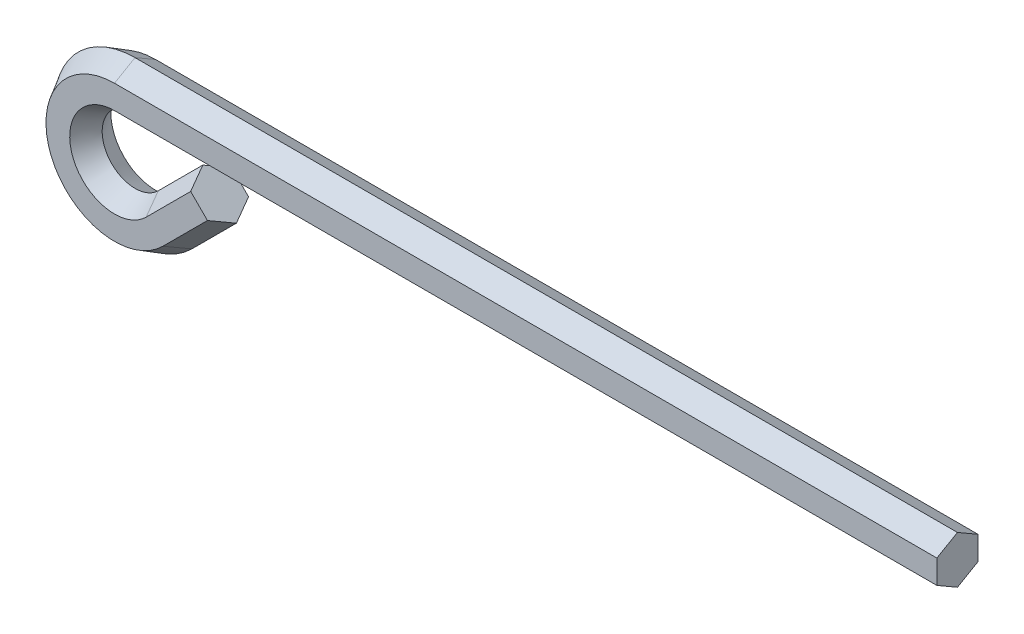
ISO-10303-21;
HEADER;
FILE_DESCRIPTION(('STEP AP214'),'2;1');
FILE_NAME('part.step','',(''),(''),'','','');
FILE_SCHEMA(('AUTOMOTIVE_DESIGN { 1 0 10303 214 1 1 1 1 }'));
ENDSEC;
DATA;
#1=APPLICATION_CONTEXT('core data for automotive mechanical design processes');
#2=APPLICATION_PROTOCOL_DEFINITION('international standard','automotive_design',2000,#1);
#3=PRODUCT_CONTEXT('',#1,'mechanical');
#4=PRODUCT('Part','Part','',(#3));
#5=PRODUCT_RELATED_PRODUCT_CATEGORY('part','',(#4));
#6=PRODUCT_DEFINITION_FORMATION('','',#4);
#7=PRODUCT_DEFINITION_CONTEXT('part definition',#1,'design');
#8=PRODUCT_DEFINITION('design','',#6,#7);
#9=PRODUCT_DEFINITION_SHAPE('','',#8);
#10=(LENGTH_UNIT() NAMED_UNIT(*) SI_UNIT(.MILLI.,.METRE.));
#11=(NAMED_UNIT(*) PLANE_ANGLE_UNIT() SI_UNIT($,.RADIAN.));
#12=(NAMED_UNIT(*) SI_UNIT($,.STERADIAN.) SOLID_ANGLE_UNIT());
#13=UNCERTAINTY_MEASURE_WITH_UNIT(LENGTH_MEASURE(1.E-05),#10,'distance_accuracy_value','');
#14=(GEOMETRIC_REPRESENTATION_CONTEXT(3) GLOBAL_UNCERTAINTY_ASSIGNED_CONTEXT((#13)) GLOBAL_UNIT_ASSIGNED_CONTEXT((#10,
#11,#12)) REPRESENTATION_CONTEXT('',''));
#15=CARTESIAN_POINT('',(0.,0.,0.));
#16=DIRECTION('',(0.,0.,1.));
#17=DIRECTION('',(1.,0.,0.));
#18=AXIS2_PLACEMENT_3D('',#15,#16,#17);
#19=CARTESIAN_POINT('',(5.89028930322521,-5.89028930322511,-2.5));
#20=DIRECTION('',(-0.612372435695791,0.612372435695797,0.500000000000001));
#21=DIRECTION('',(-0.707106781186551,-0.707106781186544,0.));
#22=AXIS2_PLACEMENT_3D('',#19,#20,#21);
#23=PLANE('',#22);
#24=DIRECTION('',(0.353553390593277,-0.353553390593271,0.866025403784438));
#25=VECTOR('',#24,1.);
#26=CARTESIAN_POINT('',(5.89028930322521,-5.89028930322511,-2.5));
#27=LINE('',#26,#25);
#28=CARTESIAN_POINT('',(5.89028930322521,-5.89028930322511,-2.5));
#29=VERTEX_POINT('',#28);
#30=CARTESIAN_POINT('',(6.91091002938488,-6.91091002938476,0.));
#31=VERTEX_POINT('',#30);
#32=EDGE_CURVE('E185',#29,#31,#27,.T.);
#33=ORIENTED_EDGE('',*,*,#32,.F.);
#34=DIRECTION('',(0.707106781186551,0.707106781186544,0.));
#35=VECTOR('',#34,1.);
#36=CARTESIAN_POINT('',(5.89028930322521,-5.89028930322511,-2.5));
#37=LINE('',#36,#35);
#38=CARTESIAN_POINT('',(11.3045028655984,-0.476075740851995,-2.5));
#39=VERTEX_POINT('',#38);
#40=EDGE_CURVE('E39',#29,#39,#37,.T.);
#41=ORIENTED_EDGE('',*,*,#40,.T.);
#42=DIRECTION('',(0.353553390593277,-0.353553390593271,0.866025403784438));
#43=VECTOR('',#42,1.);
#44=CARTESIAN_POINT('',(11.3045028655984,-0.476075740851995,-2.5));
#45=LINE('',#44,#43);
#46=CARTESIAN_POINT('',(12.3251235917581,-1.49669646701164,0.));
#47=VERTEX_POINT('',#46);
#48=EDGE_CURVE('E46',#39,#47,#45,.T.);
#49=ORIENTED_EDGE('',*,*,#48,.T.);
#50=DIRECTION('',(0.707106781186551,0.707106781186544,0.));
#51=VECTOR('',#50,1.);
#52=CARTESIAN_POINT('',(6.91091002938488,-6.91091002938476,0.));
#53=LINE('',#52,#51);
#54=EDGE_CURVE('E11',#31,#47,#53,.T.);
#55=ORIENTED_EDGE('',*,*,#54,.F.);
#56=EDGE_LOOP('',(#33,#41,#49,#55));
#57=FACE_BOUND('',#56,.T.);
#58=ADVANCED_FACE('F32',(#57),#23,.F.);
#59=CARTESIAN_POINT('',(2.82842712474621,-2.82842712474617,0.));
#60=DIRECTION('',(0.612372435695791,-0.612372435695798,0.5));
#61=DIRECTION('',(0.707106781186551,0.707106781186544,0.));
#62=AXIS2_PLACEMENT_3D('',#59,#60,#61);
#63=PLANE('',#62);
#64=DIRECTION('',(0.353553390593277,-0.353553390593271,-0.866025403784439));
#65=VECTOR('',#64,1.);
#66=CARTESIAN_POINT('',(2.82842712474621,-2.82842712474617,0.));
#67=LINE('',#66,#65);
#68=CARTESIAN_POINT('',(2.82842712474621,-2.82842712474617,0.));
#69=VERTEX_POINT('',#68);
#70=CARTESIAN_POINT('',(3.84904785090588,-3.84904785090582,-2.5));
#71=VERTEX_POINT('',#70);
#72=EDGE_CURVE('E182',#69,#71,#67,.T.);
#73=ORIENTED_EDGE('',*,*,#72,.F.);
#74=DIRECTION('',(0.707106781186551,0.707106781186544,0.));
#75=VECTOR('',#74,1.);
#76=CARTESIAN_POINT('',(2.82842712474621,-2.82842712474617,0.));
#77=LINE('',#76,#75);
#78=CARTESIAN_POINT('',(8.24264068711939,2.58578643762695,0.));
#79=VERTEX_POINT('',#78);
#80=EDGE_CURVE('E224',#69,#79,#77,.T.);
#81=ORIENTED_EDGE('',*,*,#80,.T.);
#82=DIRECTION('',(0.353553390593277,-0.353553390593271,-0.866025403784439));
#83=VECTOR('',#82,1.);
#84=CARTESIAN_POINT('',(8.24264068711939,2.58578643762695,0.));
#85=LINE('',#84,#83);
#86=CARTESIAN_POINT('',(9.26326141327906,1.5651657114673,-2.5));
#87=VERTEX_POINT('',#86);
#88=EDGE_CURVE('E214',#79,#87,#85,.T.);
#89=ORIENTED_EDGE('',*,*,#88,.T.);
#90=DIRECTION('',(0.707106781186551,0.707106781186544,0.));
#91=VECTOR('',#90,1.);
#92=CARTESIAN_POINT('',(3.84904785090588,-3.84904785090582,-2.5));
#93=LINE('',#92,#91);
#94=EDGE_CURVE('E227',#71,#87,#93,.T.);
#95=ORIENTED_EDGE('',*,*,#94,.F.);
#96=EDGE_LOOP('',(#73,#81,#89,#95));
#97=FACE_BOUND('',#96,.T.);
#98=ADVANCED_FACE('F252',(#97),#63,.F.);
#99=CARTESIAN_POINT('',(2.82842712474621,-2.82842712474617,0.));
#100=DIRECTION('',(-0.612372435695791,0.612372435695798,0.5));
#101=DIRECTION('',(-0.707106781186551,-0.707106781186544,0.));
#102=AXIS2_PLACEMENT_3D('',#99,#100,#101);
#103=PLANE('',#102);
#104=DIRECTION('',(0.353553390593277,-0.353553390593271,0.866025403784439));
#105=VECTOR('',#104,1.);
#106=CARTESIAN_POINT('',(2.82842712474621,-2.82842712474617,0.));
#107=LINE('',#106,#105);
#108=CARTESIAN_POINT('',(3.84904785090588,-3.84904785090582,2.5));
#109=VERTEX_POINT('',#108);
#110=EDGE_CURVE('E179',#69,#109,#107,.T.);
#111=ORIENTED_EDGE('',*,*,#110,.T.);
#112=DIRECTION('',(0.707106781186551,0.707106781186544,0.));
#113=VECTOR('',#112,1.);
#114=CARTESIAN_POINT('',(3.84904785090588,-3.84904785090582,2.5));
#115=LINE('',#114,#113);
#116=CARTESIAN_POINT('',(9.26326141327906,1.5651657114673,2.5));
#117=VERTEX_POINT('',#116);
#118=EDGE_CURVE('E221',#109,#117,#115,.T.);
#119=ORIENTED_EDGE('',*,*,#118,.T.);
#120=DIRECTION('',(0.353553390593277,-0.353553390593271,0.866025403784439));
#121=VECTOR('',#120,1.);
#122=CARTESIAN_POINT('',(8.24264068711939,2.58578643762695,0.));
#123=LINE('',#122,#121);
#124=EDGE_CURVE('E211',#79,#117,#123,.T.);
#125=ORIENTED_EDGE('',*,*,#124,.F.);
#126=ORIENTED_EDGE('',*,*,#80,.F.);
#127=EDGE_LOOP('',(#111,#119,#125,#126));
#128=FACE_BOUND('',#127,.T.);
#129=ADVANCED_FACE('F256',(#128),#103,.T.);
#130=CARTESIAN_POINT('',(5.89028930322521,-5.89028930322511,2.5));
#131=DIRECTION('',(0.612372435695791,-0.612372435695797,0.500000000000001));
#132=DIRECTION('',(0.707106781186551,0.707106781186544,0.));
#133=AXIS2_PLACEMENT_3D('',#130,#131,#132);
#134=PLANE('',#133);
#135=DIRECTION('',(0.353553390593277,-0.353553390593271,-0.866025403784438));
#136=VECTOR('',#135,1.);
#137=CARTESIAN_POINT('',(5.89028930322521,-5.89028930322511,2.5));
#138=LINE('',#137,#136);
#139=CARTESIAN_POINT('',(5.89028930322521,-5.89028930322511,2.5));
#140=VERTEX_POINT('',#139);
#141=EDGE_CURVE('E133',#140,#31,#138,.T.);
#142=ORIENTED_EDGE('',*,*,#141,.T.);
#143=ORIENTED_EDGE('',*,*,#54,.T.);
#144=DIRECTION('',(0.353553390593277,-0.353553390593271,-0.866025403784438));
#145=VECTOR('',#144,1.);
#146=CARTESIAN_POINT('',(11.3045028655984,-0.476075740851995,2.5));
#147=LINE('',#146,#145);
#148=CARTESIAN_POINT('',(11.3045028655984,-0.476075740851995,2.5));
#149=VERTEX_POINT('',#148);
#150=EDGE_CURVE('E206',#149,#47,#147,.T.);
#151=ORIENTED_EDGE('',*,*,#150,.F.);
#152=DIRECTION('',(0.707106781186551,0.707106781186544,0.));
#153=VECTOR('',#152,1.);
#154=CARTESIAN_POINT('',(5.89028930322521,-5.89028930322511,2.5));
#155=LINE('',#154,#153);
#156=EDGE_CURVE('E218',#140,#149,#155,.T.);
#157=ORIENTED_EDGE('',*,*,#156,.F.);
#158=EDGE_LOOP('',(#142,#143,#151,#157));
#159=FACE_BOUND('',#158,.T.);
#160=ADVANCED_FACE('F261',(#159),#134,.T.);
#161=CARTESIAN_POINT('',(0.,0.,-2.5));
#162=DIRECTION('',(0.,0.,1.));
#163=DIRECTION('',(1.,0.,0.));
#164=AXIS2_PLACEMENT_3D('',#161,#162,#163);
#165=CONICAL_SURFACE('',#164,8.33012701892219,0.523598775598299);
#166=DIRECTION('',(0.,0.500000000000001,0.866025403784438));
#167=VECTOR('',#166,1.);
#168=CARTESIAN_POINT('',(0.,8.33012701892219,-2.5));
#169=LINE('',#168,#167);
#170=CARTESIAN_POINT('',(0.,8.33012701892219,-2.5));
#171=VERTEX_POINT('',#170);
#172=CARTESIAN_POINT('',(0.,9.77350269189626,0.));
#173=VERTEX_POINT('',#172);
#174=EDGE_CURVE('E130',#171,#173,#169,.T.);
#175=ORIENTED_EDGE('',*,*,#174,.F.);
#176=CARTESIAN_POINT('',(0.,0.,-2.5));
#177=DIRECTION('',(0.,0.,1.));
#178=DIRECTION('',(1.,0.,0.));
#179=AXIS2_PLACEMENT_3D('',#176,#177,#178);
#180=CIRCLE('',#179,8.33012701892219);
#181=EDGE_CURVE('E200',#171,#29,#180,.T.);
#182=ORIENTED_EDGE('',*,*,#181,.T.);
#183=ORIENTED_EDGE('',*,*,#32,.T.);
#184=CARTESIAN_POINT('',(0.,0.,0.));
#185=DIRECTION('',(0.,0.,1.));
#186=DIRECTION('',(1.,0.,0.));
#187=AXIS2_PLACEMENT_3D('',#184,#185,#186);
#188=CIRCLE('',#187,9.77350269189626);
#189=EDGE_CURVE('E203',#173,#31,#188,.T.);
#190=ORIENTED_EDGE('',*,*,#189,.F.);
#191=EDGE_LOOP('',(#175,#182,#183,#190));
#192=FACE_BOUND('',#191,.T.);
#193=ADVANCED_FACE('F231',(#192),#165,.T.);
#194=CARTESIAN_POINT('',(0.,0.,0.));
#195=DIRECTION('',(0.,0.,-1.));
#196=DIRECTION('',(-1.,0.,0.));
#197=AXIS2_PLACEMENT_3D('',#194,#195,#196);
#198=CONICAL_SURFACE('',#197,4.,0.523598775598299);
#199=DIRECTION('',(0.,0.5,-0.866025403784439));
#200=VECTOR('',#199,1.);
#201=CARTESIAN_POINT('',(0.,4.,0.));
#202=LINE('',#201,#200);
#203=CARTESIAN_POINT('',(0.,4.,0.));
#204=VERTEX_POINT('',#203);
#205=CARTESIAN_POINT('',(0.,5.44337567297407,-2.5));
#206=VERTEX_POINT('',#205);
#207=EDGE_CURVE('E162',#204,#206,#202,.T.);
#208=ORIENTED_EDGE('',*,*,#207,.F.);
#209=CARTESIAN_POINT('',(0.,0.,0.));
#210=DIRECTION('',(0.,0.,1.));
#211=DIRECTION('',(1.,0.,0.));
#212=AXIS2_PLACEMENT_3D('',#209,#210,#211);
#213=CIRCLE('',#212,4.);
#214=EDGE_CURVE('E194',#204,#69,#213,.T.);
#215=ORIENTED_EDGE('',*,*,#214,.T.);
#216=ORIENTED_EDGE('',*,*,#72,.T.);
#217=CARTESIAN_POINT('',(0.,0.,-2.5));
#218=DIRECTION('',(0.,0.,1.));
#219=DIRECTION('',(1.,0.,0.));
#220=AXIS2_PLACEMENT_3D('',#217,#218,#219);
#221=CIRCLE('',#220,5.44337567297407);
#222=EDGE_CURVE('E197',#206,#71,#221,.T.);
#223=ORIENTED_EDGE('',*,*,#222,.F.);
#224=EDGE_LOOP('',(#208,#215,#216,#223));
#225=FACE_BOUND('',#224,.T.);
#226=ADVANCED_FACE('F248',(#225),#198,.F.);
#227=CARTESIAN_POINT('',(0.,0.,0.));
#228=DIRECTION('',(0.,0.,1.));
#229=DIRECTION('',(1.,0.,0.));
#230=AXIS2_PLACEMENT_3D('',#227,#228,#229);
#231=CONICAL_SURFACE('',#230,4.,0.523598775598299);
#232=DIRECTION('',(0.,0.5,0.866025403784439));
#233=VECTOR('',#232,1.);
#234=CARTESIAN_POINT('',(0.,4.,0.));
#235=LINE('',#234,#233);
#236=CARTESIAN_POINT('',(0.,5.44337567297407,2.5));
#237=VERTEX_POINT('',#236);
#238=EDGE_CURVE('E165',#204,#237,#235,.T.);
#239=ORIENTED_EDGE('',*,*,#238,.T.);
#240=CARTESIAN_POINT('',(0.,0.,2.5));
#241=DIRECTION('',(0.,0.,1.));
#242=DIRECTION('',(1.,0.,0.));
#243=AXIS2_PLACEMENT_3D('',#240,#241,#242);
#244=CIRCLE('',#243,5.44337567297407);
#245=EDGE_CURVE('E191',#237,#109,#244,.T.);
#246=ORIENTED_EDGE('',*,*,#245,.T.);
#247=ORIENTED_EDGE('',*,*,#110,.F.);
#248=ORIENTED_EDGE('',*,*,#214,.F.);
#249=EDGE_LOOP('',(#239,#246,#247,#248));
#250=FACE_BOUND('',#249,.T.);
#251=ADVANCED_FACE('F254',(#250),#231,.F.);
#252=CARTESIAN_POINT('',(0.,0.,2.5));
#253=DIRECTION('',(0.,0.,-1.));
#254=DIRECTION('',(-1.,0.,0.));
#255=AXIS2_PLACEMENT_3D('',#252,#253,#254);
#256=CONICAL_SURFACE('',#255,8.33012701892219,0.523598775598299);
#257=DIRECTION('',(0.,0.500000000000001,-0.866025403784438));
#258=VECTOR('',#257,1.);
#259=CARTESIAN_POINT('',(0.,8.33012701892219,2.5));
#260=LINE('',#259,#258);
#261=CARTESIAN_POINT('',(0.,8.33012701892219,2.5));
#262=VERTEX_POINT('',#261);
#263=EDGE_CURVE('E158',#262,#173,#260,.T.);
#264=ORIENTED_EDGE('',*,*,#263,.T.);
#265=ORIENTED_EDGE('',*,*,#189,.T.);
#266=ORIENTED_EDGE('',*,*,#141,.F.);
#267=CARTESIAN_POINT('',(0.,0.,2.5));
#268=DIRECTION('',(0.,0.,1.));
#269=DIRECTION('',(1.,0.,0.));
#270=AXIS2_PLACEMENT_3D('',#267,#268,#269);
#271=CIRCLE('',#270,8.33012701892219);
#272=EDGE_CURVE('E188',#262,#140,#271,.T.);
#273=ORIENTED_EDGE('',*,*,#272,.F.);
#274=EDGE_LOOP('',(#264,#265,#266,#273));
#275=FACE_BOUND('',#274,.T.);
#276=ADVANCED_FACE('F234',(#275),#256,.T.);
#277=CARTESIAN_POINT('',(0.,8.33012701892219,2.5));
#278=DIRECTION('',(0.,-0.866025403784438,-0.500000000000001));
#279=DIRECTION('',(0.,0.500000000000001,-0.866025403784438));
#280=AXIS2_PLACEMENT_3D('',#277,#278,#279);
#281=PLANE('',#280);
#282=DIRECTION('',(0.,0.500000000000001,-0.866025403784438));
#283=VECTOR('',#282,1.);
#284=CARTESIAN_POINT('',(100.,8.33012701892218,2.5));
#285=LINE('',#284,#283);
#286=CARTESIAN_POINT('',(100.,8.33012701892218,2.5));
#287=VERTEX_POINT('',#286);
#288=CARTESIAN_POINT('',(100.,9.77350269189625,0.));
#289=VERTEX_POINT('',#288);
#290=EDGE_CURVE('E138',#287,#289,#285,.T.);
#291=ORIENTED_EDGE('',*,*,#290,.T.);
#292=DIRECTION('',(1.,0.,0.));
#293=VECTOR('',#292,1.);
#294=CARTESIAN_POINT('',(0.,9.77350269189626,0.));
#295=LINE('',#294,#293);
#296=EDGE_CURVE('E122',#173,#289,#295,.T.);
#297=ORIENTED_EDGE('',*,*,#296,.F.);
#298=ORIENTED_EDGE('',*,*,#263,.F.);
#299=DIRECTION('',(1.,0.,0.));
#300=VECTOR('',#299,1.);
#301=CARTESIAN_POINT('',(0.,8.33012701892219,2.5));
#302=LINE('',#301,#300);
#303=EDGE_CURVE('E141',#262,#287,#302,.T.);
#304=ORIENTED_EDGE('',*,*,#303,.T.);
#305=EDGE_LOOP('',(#291,#297,#298,#304));
#306=FACE_BOUND('',#305,.T.);
#307=ADVANCED_FACE('F139',(#306),#281,.F.);
#308=CARTESIAN_POINT('',(0.,8.33012701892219,-2.5));
#309=DIRECTION('',(0.,0.866025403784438,-0.500000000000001));
#310=DIRECTION('',(0.,0.500000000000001,0.866025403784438));
#311=AXIS2_PLACEMENT_3D('',#308,#309,#310);
#312=PLANE('',#311);
#313=DIRECTION('',(0.,0.500000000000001,0.866025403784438));
#314=VECTOR('',#313,1.);
#315=CARTESIAN_POINT('',(100.,8.33012701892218,-2.5));
#316=LINE('',#315,#314);
#317=CARTESIAN_POINT('',(100.,8.33012701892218,-2.5));
#318=VERTEX_POINT('',#317);
#319=EDGE_CURVE('E127',#318,#289,#316,.T.);
#320=ORIENTED_EDGE('',*,*,#319,.F.);
#321=DIRECTION('',(1.,0.,0.));
#322=VECTOR('',#321,1.);
#323=CARTESIAN_POINT('',(0.,8.33012701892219,-2.5));
#324=LINE('',#323,#322);
#325=EDGE_CURVE('E134',#171,#318,#324,.T.);
#326=ORIENTED_EDGE('',*,*,#325,.F.);
#327=ORIENTED_EDGE('',*,*,#174,.T.);
#328=ORIENTED_EDGE('',*,*,#296,.T.);
#329=EDGE_LOOP('',(#320,#326,#327,#328));
#330=FACE_BOUND('',#329,.T.);
#331=ADVANCED_FACE('F124',(#330),#312,.T.);
#332=CARTESIAN_POINT('',(0.,5.44337567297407,-2.5));
#333=DIRECTION('',(0.,0.,-1.));
#334=DIRECTION('',(-1.,0.,0.));
#335=AXIS2_PLACEMENT_3D('',#332,#333,#334);
#336=PLANE('',#335);
#337=DIRECTION('',(0.,1.,0.));
#338=VECTOR('',#337,1.);
#339=CARTESIAN_POINT('',(100.,5.44337567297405,-2.5));
#340=LINE('',#339,#338);
#341=CARTESIAN_POINT('',(100.,5.44337567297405,-2.5));
#342=VERTEX_POINT('',#341);
#343=EDGE_CURVE('E148',#342,#318,#340,.T.);
#344=ORIENTED_EDGE('',*,*,#343,.F.);
#345=DIRECTION('',(1.,0.,0.));
#346=VECTOR('',#345,1.);
#347=CARTESIAN_POINT('',(0.,5.44337567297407,-2.5));
#348=LINE('',#347,#346);
#349=EDGE_CURVE('E174',#206,#342,#348,.T.);
#350=ORIENTED_EDGE('',*,*,#349,.F.);
#351=ORIENTED_EDGE('',*,*,#222,.T.);
#352=ORIENTED_EDGE('',*,*,#94,.T.);
#353=DIRECTION('',(0.707106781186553,-0.707106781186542,0.));
#354=VECTOR('',#353,1.);
#355=CARTESIAN_POINT('',(9.26326141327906,1.5651657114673,-2.5));
#356=LINE('',#355,#354);
#357=EDGE_CURVE('E54',#87,#39,#356,.T.);
#358=ORIENTED_EDGE('',*,*,#357,.T.);
#359=ORIENTED_EDGE('',*,*,#40,.F.);
#360=ORIENTED_EDGE('',*,*,#181,.F.);
#361=ORIENTED_EDGE('',*,*,#325,.T.);
#362=EDGE_LOOP('',(#344,#350,#351,#352,#358,#359,#360,#361));
#363=FACE_BOUND('',#362,.T.);
#364=ADVANCED_FACE('F229',(#363),#336,.T.);
#365=CARTESIAN_POINT('',(0.,4.,0.));
#366=DIRECTION('',(0.,-0.866025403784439,-0.5));
#367=DIRECTION('',(0.,0.5,-0.866025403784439));
#368=AXIS2_PLACEMENT_3D('',#365,#366,#367);
#369=PLANE('',#368);
#370=DIRECTION('',(0.,0.5,-0.866025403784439));
#371=VECTOR('',#370,1.);
#372=CARTESIAN_POINT('',(100.,3.99999999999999,0.));
#373=LINE('',#372,#371);
#374=CARTESIAN_POINT('',(100.,3.99999999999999,0.));
#375=VERTEX_POINT('',#374);
#376=EDGE_CURVE('E150',#375,#342,#373,.T.);
#377=ORIENTED_EDGE('',*,*,#376,.F.);
#378=DIRECTION('',(1.,0.,0.));
#379=VECTOR('',#378,1.);
#380=CARTESIAN_POINT('',(0.,4.,0.));
#381=LINE('',#380,#379);
#382=EDGE_CURVE('E172',#204,#375,#381,.T.);
#383=ORIENTED_EDGE('',*,*,#382,.F.);
#384=ORIENTED_EDGE('',*,*,#207,.T.);
#385=ORIENTED_EDGE('',*,*,#349,.T.);
#386=EDGE_LOOP('',(#377,#383,#384,#385));
#387=FACE_BOUND('',#386,.T.);
#388=ADVANCED_FACE('F243',(#387),#369,.T.);
#389=CARTESIAN_POINT('',(0.,4.,0.));
#390=DIRECTION('',(0.,0.866025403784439,-0.5));
#391=DIRECTION('',(0.,0.5,0.866025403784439));
#392=AXIS2_PLACEMENT_3D('',#389,#390,#391);
#393=PLANE('',#392);
#394=DIRECTION('',(0.,0.5,0.866025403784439));
#395=VECTOR('',#394,1.);
#396=CARTESIAN_POINT('',(100.,3.99999999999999,0.));
#397=LINE('',#396,#395);
#398=CARTESIAN_POINT('',(100.,5.44337567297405,2.5));
#399=VERTEX_POINT('',#398);
#400=EDGE_CURVE('E154',#375,#399,#397,.T.);
#401=ORIENTED_EDGE('',*,*,#400,.T.);
#402=DIRECTION('',(1.,0.,0.));
#403=VECTOR('',#402,1.);
#404=CARTESIAN_POINT('',(0.,5.44337567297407,2.5));
#405=LINE('',#404,#403);
#406=EDGE_CURVE('E169',#237,#399,#405,.T.);
#407=ORIENTED_EDGE('',*,*,#406,.F.);
#408=ORIENTED_EDGE('',*,*,#238,.F.);
#409=ORIENTED_EDGE('',*,*,#382,.T.);
#410=EDGE_LOOP('',(#401,#407,#408,#409));
#411=FACE_BOUND('',#410,.T.);
#412=ADVANCED_FACE('F262',(#411),#393,.F.);
#413=CARTESIAN_POINT('',(0.,5.44337567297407,2.5));
#414=DIRECTION('',(0.,0.,-1.));
#415=DIRECTION('',(-1.,0.,0.));
#416=AXIS2_PLACEMENT_3D('',#413,#414,#415);
#417=PLANE('',#416);
#418=DIRECTION('',(0.,1.,0.));
#419=VECTOR('',#418,1.);
#420=CARTESIAN_POINT('',(100.,5.44337567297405,2.5));
#421=LINE('',#420,#419);
#422=EDGE_CURVE('E156',#399,#287,#421,.T.);
#423=ORIENTED_EDGE('',*,*,#422,.T.);
#424=ORIENTED_EDGE('',*,*,#303,.F.);
#425=ORIENTED_EDGE('',*,*,#272,.T.);
#426=ORIENTED_EDGE('',*,*,#156,.T.);
#427=DIRECTION('',(0.707106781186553,-0.707106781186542,0.));
#428=VECTOR('',#427,1.);
#429=CARTESIAN_POINT('',(9.26326141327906,1.5651657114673,2.5));
#430=LINE('',#429,#428);
#431=EDGE_CURVE('E208',#117,#149,#430,.T.);
#432=ORIENTED_EDGE('',*,*,#431,.F.);
#433=ORIENTED_EDGE('',*,*,#118,.F.);
#434=ORIENTED_EDGE('',*,*,#245,.F.);
#435=ORIENTED_EDGE('',*,*,#406,.T.);
#436=EDGE_LOOP('',(#423,#424,#425,#426,#432,#433,#434,#435));
#437=FACE_BOUND('',#436,.T.);
#438=ADVANCED_FACE('F236',(#437),#417,.F.);
#439=CARTESIAN_POINT('',(12.3251235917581,-1.49669646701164,0.));
#440=DIRECTION('',(-0.707106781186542,-0.707106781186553,0.));
#441=DIRECTION('',(0.,0.,-1.));
#442=AXIS2_PLACEMENT_3D('',#439,#440,#441);
#443=PLANE('',#442);
#444=ORIENTED_EDGE('',*,*,#150,.T.);
#445=ORIENTED_EDGE('',*,*,#48,.F.);
#446=ORIENTED_EDGE('',*,*,#357,.F.);
#447=ORIENTED_EDGE('',*,*,#88,.F.);
#448=ORIENTED_EDGE('',*,*,#124,.T.);
#449=ORIENTED_EDGE('',*,*,#431,.T.);
#450=EDGE_LOOP('',(#444,#445,#446,#447,#448,#449));
#451=FACE_BOUND('',#450,.T.);
#452=ADVANCED_FACE('F259',(#451),#443,.F.);
#453=CARTESIAN_POINT('',(100.,9.77350269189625,0.));
#454=DIRECTION('',(1.,0.,0.));
#455=DIRECTION('',(0.,0.,-1.));
#456=AXIS2_PLACEMENT_3D('',#453,#454,#455);
#457=PLANE('',#456);
#458=ORIENTED_EDGE('',*,*,#290,.F.);
#459=ORIENTED_EDGE('',*,*,#422,.F.);
#460=ORIENTED_EDGE('',*,*,#400,.F.);
#461=ORIENTED_EDGE('',*,*,#376,.T.);
#462=ORIENTED_EDGE('',*,*,#343,.T.);
#463=ORIENTED_EDGE('',*,*,#319,.T.);
#464=EDGE_LOOP('',(#458,#459,#460,#461,#462,#463));
#465=FACE_BOUND('',#464,.T.);
#466=ADVANCED_FACE('F145',(#465),#457,.T.);
#467=CLOSED_SHELL('',(#58,#98,#129,#160,#193,#226,#251,#276,#307,#331,#364,#388,#412,#438,#452,#466));
#468=MANIFOLD_SOLID_BREP('B2',#467);
#469=ADVANCED_BREP_SHAPE_REPRESENTATION('',(#18,#468),#14);
#470=SHAPE_DEFINITION_REPRESENTATION(#9,#469);
ENDSEC;
END-ISO-10303-21;
